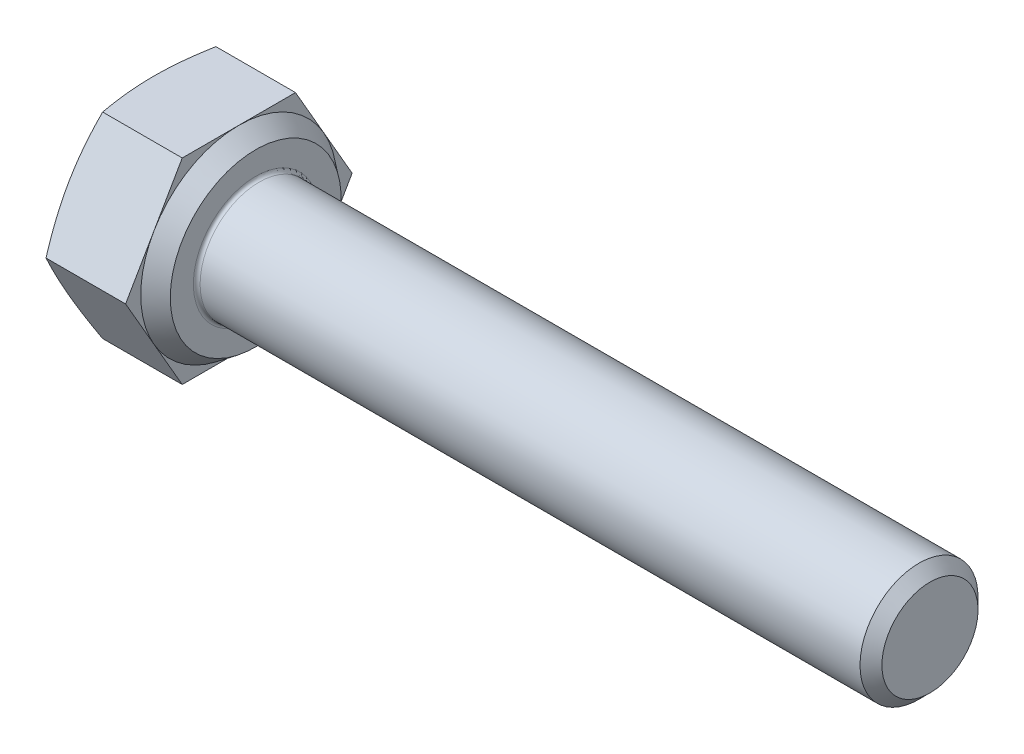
ISO-10303-21;
HEADER;
FILE_DESCRIPTION(('STEP AP214'),'2;1');
FILE_NAME('part.step','',(''),(''),'','','');
FILE_SCHEMA(('AUTOMOTIVE_DESIGN { 1 0 10303 214 1 1 1 1 }'));
ENDSEC;
DATA;
#1=APPLICATION_CONTEXT('core data for automotive mechanical design processes');
#2=APPLICATION_PROTOCOL_DEFINITION('international standard','automotive_design',2000,#1);
#3=PRODUCT_CONTEXT('',#1,'mechanical');
#4=PRODUCT('Part','Part','',(#3));
#5=PRODUCT_RELATED_PRODUCT_CATEGORY('part','',(#4));
#6=PRODUCT_DEFINITION_FORMATION('','',#4);
#7=PRODUCT_DEFINITION_CONTEXT('part definition',#1,'design');
#8=PRODUCT_DEFINITION('design','',#6,#7);
#9=PRODUCT_DEFINITION_SHAPE('','',#8);
#10=(LENGTH_UNIT() NAMED_UNIT(*) SI_UNIT(.MILLI.,.METRE.));
#11=(NAMED_UNIT(*) PLANE_ANGLE_UNIT() SI_UNIT($,.RADIAN.));
#12=(NAMED_UNIT(*) SI_UNIT($,.STERADIAN.) SOLID_ANGLE_UNIT());
#13=UNCERTAINTY_MEASURE_WITH_UNIT(LENGTH_MEASURE(1.E-05),#10,'distance_accuracy_value','');
#14=(GEOMETRIC_REPRESENTATION_CONTEXT(3) GLOBAL_UNCERTAINTY_ASSIGNED_CONTEXT((#13)) GLOBAL_UNIT_ASSIGNED_CONTEXT((#10,
#11,#12)) REPRESENTATION_CONTEXT('',''));
#15=CARTESIAN_POINT('',(0.,0.,0.));
#16=DIRECTION('',(0.,0.,1.));
#17=DIRECTION('',(1.,0.,0.));
#18=AXIS2_PLACEMENT_3D('',#15,#16,#17);
#19=CARTESIAN_POINT('',(3.025,0.,0.));
#20=DIRECTION('',(1.,0.,0.));
#21=DIRECTION('',(0.,0.,-1.));
#22=AXIS2_PLACEMENT_3D('',#19,#20,#21);
#23=PLANE('',#22);
#24=CARTESIAN_POINT('',(3.025,0.,0.));
#25=DIRECTION('',(1.,0.,0.));
#26=DIRECTION('',(0.,0.,-1.));
#27=AXIS2_PLACEMENT_3D('',#24,#25,#26);
#28=CIRCLE('',#27,1.85);
#29=CARTESIAN_POINT('',(3.025,0.,-1.85));
#30=VERTEX_POINT('',#29);
#31=EDGE_CURVE('E188',#30,#30,#28,.F.);
#32=ORIENTED_EDGE('',*,*,#31,.T.);
#33=EDGE_LOOP('',(#32));
#34=FACE_BOUND('',#33,.T.);
#35=CARTESIAN_POINT('',(3.025,0.,0.));
#36=DIRECTION('',(-1.,0.,0.));
#37=DIRECTION('',(0.,0.,1.));
#38=AXIS2_PLACEMENT_3D('',#35,#36,#37);
#39=CIRCLE('',#38,2.535);
#40=CARTESIAN_POINT('',(3.025,0.,2.535));
#41=VERTEX_POINT('',#40);
#42=EDGE_CURVE('E139',#41,#41,#39,.T.);
#43=ORIENTED_EDGE('',*,*,#42,.F.);
#44=EDGE_LOOP('',(#43));
#45=FACE_BOUND('',#44,.T.);
#46=ADVANCED_FACE('F33',(#34,#45),#23,.T.);
#47=CARTESIAN_POINT('',(2.525,0.,-3.36017856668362));
#48=DIRECTION('',(1.,0.,0.));
#49=DIRECTION('',(0.,0.,-1.));
#50=AXIS2_PLACEMENT_3D('',#47,#48,#49);
#51=PLANE('',#50);
#52=DIRECTION('',(0.,-0.866025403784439,0.5));
#53=VECTOR('',#52,1.);
#54=CARTESIAN_POINT('',(2.525,2.91,1.68008928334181));
#55=LINE('',#54,#53);
#56=CARTESIAN_POINT('',(2.525,2.91,1.68008928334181));
#57=VERTEX_POINT('',#56);
#58=CARTESIAN_POINT('',(2.525,1.455,2.52013392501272));
#59=VERTEX_POINT('',#58);
#60=EDGE_CURVE('E138',#57,#59,#55,.T.);
#61=ORIENTED_EDGE('',*,*,#60,.T.);
#62=CARTESIAN_POINT('',(2.525,0.,0.));
#63=DIRECTION('',(-1.,0.,0.));
#64=DIRECTION('',(0.,0.,1.));
#65=AXIS2_PLACEMENT_3D('',#62,#63,#64);
#66=CIRCLE('',#65,2.91);
#67=CARTESIAN_POINT('',(2.525,2.91,0.));
#68=VERTEX_POINT('',#67);
#69=EDGE_CURVE('E49',#59,#68,#66,.T.);
#70=ORIENTED_EDGE('',*,*,#69,.T.);
#71=DIRECTION('',(0.,0.,1.));
#72=VECTOR('',#71,1.);
#73=CARTESIAN_POINT('',(2.525,2.91,-1.68008928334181));
#74=LINE('',#73,#72);
#75=EDGE_CURVE('E135',#68,#57,#74,.T.);
#76=ORIENTED_EDGE('',*,*,#75,.T.);
#77=EDGE_LOOP('',(#61,#70,#76));
#78=FACE_BOUND('',#77,.T.);
#79=ADVANCED_FACE('F134',(#78),#51,.T.);
#80=CARTESIAN_POINT('',(2.525,2.91,-1.68008928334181));
#81=VERTEX_POINT('',#80);
#82=EDGE_CURVE('E145',#81,#68,#74,.T.);
#83=ORIENTED_EDGE('',*,*,#82,.T.);
#84=CARTESIAN_POINT('',(2.525,1.455,-2.52013392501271));
#85=VERTEX_POINT('',#84);
#86=EDGE_CURVE('E122',#68,#85,#66,.T.);
#87=ORIENTED_EDGE('',*,*,#86,.T.);
#88=DIRECTION('',(0.,0.866025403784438,0.5));
#89=VECTOR('',#88,1.);
#90=CARTESIAN_POINT('',(2.525,0.,-3.36017856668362));
#91=LINE('',#90,#89);
#92=EDGE_CURVE('E151',#85,#81,#91,.T.);
#93=ORIENTED_EDGE('',*,*,#92,.T.);
#94=EDGE_LOOP('',(#83,#87,#93));
#95=FACE_BOUND('',#94,.T.);
#96=ADVANCED_FACE('F150',(#95),#51,.T.);
#97=CARTESIAN_POINT('',(2.525,0.,-3.36017856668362));
#98=VERTEX_POINT('',#97);
#99=EDGE_CURVE('E148',#98,#85,#91,.T.);
#100=ORIENTED_EDGE('',*,*,#99,.T.);
#101=CARTESIAN_POINT('',(2.525,-1.455,-2.52013392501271));
#102=VERTEX_POINT('',#101);
#103=EDGE_CURVE('E125',#85,#102,#66,.T.);
#104=ORIENTED_EDGE('',*,*,#103,.T.);
#105=DIRECTION('',(0.,0.866025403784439,-0.5));
#106=VECTOR('',#105,1.);
#107=CARTESIAN_POINT('',(2.525,-2.91,-1.68008928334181));
#108=LINE('',#107,#106);
#109=EDGE_CURVE('E306',#102,#98,#108,.T.);
#110=ORIENTED_EDGE('',*,*,#109,.T.);
#111=EDGE_LOOP('',(#100,#104,#110));
#112=FACE_BOUND('',#111,.T.);
#113=ADVANCED_FACE('F337',(#112),#51,.T.);
#114=CARTESIAN_POINT('',(2.525,-2.91,-1.68008928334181));
#115=VERTEX_POINT('',#114);
#116=EDGE_CURVE('E304',#115,#102,#108,.T.);
#117=ORIENTED_EDGE('',*,*,#116,.T.);
#118=CARTESIAN_POINT('',(2.525,-2.91,0.));
#119=VERTEX_POINT('',#118);
#120=EDGE_CURVE('E338',#102,#119,#66,.T.);
#121=ORIENTED_EDGE('',*,*,#120,.T.);
#122=DIRECTION('',(0.,0.,-1.));
#123=VECTOR('',#122,1.);
#124=CARTESIAN_POINT('',(2.525,-2.91,1.68008928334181));
#125=LINE('',#124,#123);
#126=EDGE_CURVE('E162',#119,#115,#125,.T.);
#127=ORIENTED_EDGE('',*,*,#126,.T.);
#128=EDGE_LOOP('',(#117,#121,#127));
#129=FACE_BOUND('',#128,.T.);
#130=ADVANCED_FACE('F352',(#129),#51,.T.);
#131=CARTESIAN_POINT('',(2.525,-2.91,1.68008928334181));
#132=VERTEX_POINT('',#131);
#133=EDGE_CURVE('E163',#132,#119,#125,.T.);
#134=ORIENTED_EDGE('',*,*,#133,.T.);
#135=CARTESIAN_POINT('',(2.525,-1.455,2.52013392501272));
#136=VERTEX_POINT('',#135);
#137=EDGE_CURVE('E339',#119,#136,#66,.T.);
#138=ORIENTED_EDGE('',*,*,#137,.T.);
#139=DIRECTION('',(0.,-0.866025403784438,-0.5));
#140=VECTOR('',#139,1.);
#141=CARTESIAN_POINT('',(2.525,0.,3.36017856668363));
#142=LINE('',#141,#140);
#143=EDGE_CURVE('E158',#136,#132,#142,.T.);
#144=ORIENTED_EDGE('',*,*,#143,.T.);
#145=EDGE_LOOP('',(#134,#138,#144));
#146=FACE_BOUND('',#145,.T.);
#147=ADVANCED_FACE('F347',(#146),#51,.T.);
#148=CARTESIAN_POINT('',(2.525,0.,3.36017856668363));
#149=VERTEX_POINT('',#148);
#150=EDGE_CURVE('E159',#149,#136,#142,.T.);
#151=ORIENTED_EDGE('',*,*,#150,.T.);
#152=EDGE_CURVE('E140',#136,#59,#66,.T.);
#153=ORIENTED_EDGE('',*,*,#152,.T.);
#154=EDGE_CURVE('E153',#59,#149,#55,.T.);
#155=ORIENTED_EDGE('',*,*,#154,.T.);
#156=EDGE_LOOP('',(#151,#153,#155));
#157=FACE_BOUND('',#156,.T.);
#158=ADVANCED_FACE('F213',(#157),#51,.T.);
#159=CARTESIAN_POINT('',(2.525,-2.91,-1.68008928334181));
#160=DIRECTION('',(0.,0.5,0.866025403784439));
#161=DIRECTION('',(0.,-0.866025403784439,0.5));
#162=AXIS2_PLACEMENT_3D('',#159,#160,#161);
#163=PLANE('',#162);
#164=CARTESIAN_POINT('',(0.163893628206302,0.000199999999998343,-3.36029403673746));
#165=CARTESIAN_POINT('',(0.138555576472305,-0.120325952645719,-3.29070834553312));
#166=CARTESIAN_POINT('',(0.115506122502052,-0.241249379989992,-3.22089317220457));
#167=CARTESIAN_POINT('',(0.0749540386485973,-0.483882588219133,-3.08080882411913));
#168=CARTESIAN_POINT('',(0.0574557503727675,-0.605592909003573,-3.01053933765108));
#169=CARTESIAN_POINT('',(0.029152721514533,-0.848449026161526,-2.87032629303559));
#170=CARTESIAN_POINT('',(0.0182862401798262,-0.969589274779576,-2.80038593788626));
#171=CARTESIAN_POINT('',(0.00371122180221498,-1.2121530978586,-2.66034164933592));
#172=CARTESIAN_POINT('',(0.,-1.3335765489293,-2.59023778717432));
#173=CARTESIAN_POINT('',(0.,-1.5764234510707,-2.45003006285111));
#174=CARTESIAN_POINT('',(0.00371122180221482,-1.6978469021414,-2.37992620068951));
#175=CARTESIAN_POINT('',(0.0182862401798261,-1.94041072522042,-2.23988191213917));
#176=CARTESIAN_POINT('',(0.0291527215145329,-2.06155097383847,-2.16994155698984));
#177=CARTESIAN_POINT('',(0.0574557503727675,-2.30440709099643,-2.02972851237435));
#178=CARTESIAN_POINT('',(0.0749540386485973,-2.42611741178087,-1.9594590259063));
#179=CARTESIAN_POINT('',(0.115506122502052,-2.66875062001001,-1.81937467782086));
#180=CARTESIAN_POINT('',(0.138555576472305,-2.78967404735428,-1.74955950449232));
#181=CARTESIAN_POINT('',(0.163893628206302,-2.9102,-1.67997381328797));
#182=B_SPLINE_CURVE_WITH_KNOTS('',3,(#164,#165,#166,#167,#168,#169,#170,#171,#172,#173,#174,
#175,#176,#177,#178,#179,#180,#181),.UNSPECIFIED.,.F.,.F.,(4,2,2,2,2,2,2,2,4),(0.,
0.424421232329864,0.849173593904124,1.26990875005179,1.69048600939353,2.11106326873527,
2.53179842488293,2.95655078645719,3.38097201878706),.UNSPECIFIED.);
#183=CARTESIAN_POINT('',(0.163851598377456,0.,-3.36017856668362));
#184=VERTEX_POINT('',#183);
#185=CARTESIAN_POINT('',(0.,-1.455,-2.52013392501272));
#186=VERTEX_POINT('',#185);
#187=EDGE_CURVE('E321',#184,#186,#182,.T.);
#188=ORIENTED_EDGE('',*,*,#187,.F.);
#189=DIRECTION('',(-1.,0.,0.));
#190=VECTOR('',#189,1.);
#191=CARTESIAN_POINT('',(2.525,0.,-3.36017856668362));
#192=LINE('',#191,#190);
#193=EDGE_CURVE('E178',#98,#184,#192,.T.);
#194=ORIENTED_EDGE('',*,*,#193,.F.);
#195=ORIENTED_EDGE('',*,*,#109,.F.);
#196=ORIENTED_EDGE('',*,*,#116,.F.);
#197=DIRECTION('',(-1.,0.,0.));
#198=VECTOR('',#197,1.);
#199=CARTESIAN_POINT('',(2.525,-2.91,-1.68008928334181));
#200=LINE('',#199,#198);
#201=CARTESIAN_POINT('',(0.163851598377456,-2.91,-1.68008928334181));
#202=VERTEX_POINT('',#201);
#203=EDGE_CURVE('E166',#115,#202,#200,.T.);
#204=ORIENTED_EDGE('',*,*,#203,.T.);
#205=EDGE_CURVE('E246',#186,#202,#182,.T.);
#206=ORIENTED_EDGE('',*,*,#205,.F.);
#207=EDGE_LOOP('',(#188,#194,#195,#196,#204,#206));
#208=FACE_BOUND('',#207,.T.);
#209=ADVANCED_FACE('F35',(#208),#163,.F.);
#210=CARTESIAN_POINT('',(2.525,0.,-3.36017856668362));
#211=DIRECTION('',(0.,-0.5,0.866025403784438));
#212=DIRECTION('',(0.,-0.866025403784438,-0.5));
#213=AXIS2_PLACEMENT_3D('',#210,#211,#212);
#214=PLANE('',#213);
#215=CARTESIAN_POINT('',(0.163893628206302,2.9102,-1.67997381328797));
#216=CARTESIAN_POINT('',(0.138555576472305,2.78967404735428,-1.74955950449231));
#217=CARTESIAN_POINT('',(0.115506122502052,2.66875062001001,-1.81937467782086));
#218=CARTESIAN_POINT('',(0.0749540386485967,2.42611741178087,-1.9594590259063));
#219=CARTESIAN_POINT('',(0.057455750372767,2.30440709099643,-2.02972851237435));
#220=CARTESIAN_POINT('',(0.0291527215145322,2.06155097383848,-2.16994155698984));
#221=CARTESIAN_POINT('',(0.0182862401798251,1.94041072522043,-2.23988191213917));
#222=CARTESIAN_POINT('',(0.00371122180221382,1.6978469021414,-2.37992620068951));
#223=CARTESIAN_POINT('',(0.,1.5764234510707,-2.45003006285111));
#224=CARTESIAN_POINT('',(0.,1.3335765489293,-2.59023778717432));
#225=CARTESIAN_POINT('',(0.00371122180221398,1.2121530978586,-2.66034164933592));
#226=CARTESIAN_POINT('',(0.0182862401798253,0.969589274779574,-2.80038593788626));
#227=CARTESIAN_POINT('',(0.0291527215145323,0.848449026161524,-2.87032629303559));
#228=CARTESIAN_POINT('',(0.0574557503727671,0.605592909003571,-3.01053933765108));
#229=CARTESIAN_POINT('',(0.0749540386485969,0.483882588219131,-3.08080882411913));
#230=CARTESIAN_POINT('',(0.115506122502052,0.241249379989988,-3.22089317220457));
#231=CARTESIAN_POINT('',(0.138555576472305,0.120325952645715,-3.29070834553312));
#232=CARTESIAN_POINT('',(0.163893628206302,-0.000200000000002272,-3.36029403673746));
#233=B_SPLINE_CURVE_WITH_KNOTS('',3,(#215,#216,#217,#218,#219,#220,#221,#222,#223,#224,#225,
#226,#227,#228,#229,#230,#231,#232),.UNSPECIFIED.,.F.,.F.,(4,2,2,2,2,2,2,2,4),(0.,
0.424421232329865,0.849173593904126,1.26990875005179,1.69048600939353,2.11106326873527,
2.53179842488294,2.9565507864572,3.38097201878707),.UNSPECIFIED.);
#234=CARTESIAN_POINT('',(0.163851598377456,2.91,-1.68008928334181));
#235=VERTEX_POINT('',#234);
#236=CARTESIAN_POINT('',(0.,1.455,-2.52013392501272));
#237=VERTEX_POINT('',#236);
#238=EDGE_CURVE('E261',#235,#237,#233,.T.);
#239=ORIENTED_EDGE('',*,*,#238,.F.);
#240=DIRECTION('',(-1.,0.,0.));
#241=VECTOR('',#240,1.);
#242=CARTESIAN_POINT('',(2.525,2.91,-1.68008928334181));
#243=LINE('',#242,#241);
#244=EDGE_CURVE('E176',#81,#235,#243,.T.);
#245=ORIENTED_EDGE('',*,*,#244,.F.);
#246=ORIENTED_EDGE('',*,*,#92,.F.);
#247=ORIENTED_EDGE('',*,*,#99,.F.);
#248=ORIENTED_EDGE('',*,*,#193,.T.);
#249=EDGE_CURVE('E257',#237,#184,#233,.T.);
#250=ORIENTED_EDGE('',*,*,#249,.F.);
#251=EDGE_LOOP('',(#239,#245,#246,#247,#248,#250));
#252=FACE_BOUND('',#251,.T.);
#253=ADVANCED_FACE('F267',(#252),#214,.F.);
#254=CARTESIAN_POINT('',(2.525,2.91,-1.68008928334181));
#255=DIRECTION('',(0.,-1.,0.));
#256=DIRECTION('',(0.,0.,-1.));
#257=AXIS2_PLACEMENT_3D('',#254,#255,#256);
#258=PLANE('',#257);
#259=CARTESIAN_POINT('',(0.875557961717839,2.91,-4.44828566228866));
#260=CARTESIAN_POINT('',(0.835467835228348,2.91,-4.31662666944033));
#261=CARTESIAN_POINT('',(0.795845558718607,2.91,-4.18482268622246));
#262=CARTESIAN_POINT('',(0.717795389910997,2.91,-3.92085066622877));
#263=CARTESIAN_POINT('',(0.679367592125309,2.91,-3.78868260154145));
#264=CARTESIAN_POINT('',(0.60390114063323,2.91,-3.52368212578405));
#265=CARTESIAN_POINT('',(0.566865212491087,2.91,-3.39084893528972));
#266=CARTESIAN_POINT('',(0.494616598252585,2.91,-3.12468925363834));
#267=CARTESIAN_POINT('',(0.459403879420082,2.91,-2.99136277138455));
#268=CARTESIAN_POINT('',(0.391671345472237,2.91,-2.72577136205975));
#269=CARTESIAN_POINT('',(0.359123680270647,2.91,-2.59351361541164));
#270=CARTESIAN_POINT('',(0.29680485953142,2.91,-2.32835118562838));
#271=CARTESIAN_POINT('',(0.267033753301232,2.91,-2.1954464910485));
#272=CARTESIAN_POINT('',(0.182899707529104,2.91,-1.79569866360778));
#273=CARTESIAN_POINT('',(0.133682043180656,2.91,-1.52769353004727));
#274=CARTESIAN_POINT('',(0.0774837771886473,2.91,-1.13855650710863));
#275=CARTESIAN_POINT('',(0.0622341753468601,2.91,-1.01861137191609));
#276=CARTESIAN_POINT('',(0.0364236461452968,2.91,-0.778222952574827));
#277=CARTESIAN_POINT('',(0.0258621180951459,2.91,-0.657779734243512));
#278=CARTESIAN_POINT('',(0.00993064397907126,2.91,-0.416625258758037));
#279=CARTESIAN_POINT('',(0.00455728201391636,2.91,-0.295914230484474));
#280=CARTESIAN_POINT('',(-0.000724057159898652,2.91,-0.0543712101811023));
#281=CARTESIAN_POINT('',(-0.000632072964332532,2.91,0.0664607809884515));
#282=CARTESIAN_POINT('',(0.00502629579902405,2.91,0.308607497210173));
#283=CARTESIAN_POINT('',(0.0106204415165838,2.91,0.429921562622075));
#284=CARTESIAN_POINT('',(0.0270260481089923,2.91,0.672193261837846));
#285=CARTESIAN_POINT('',(0.0378376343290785,2.91,0.793150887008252));
#286=CARTESIAN_POINT('',(0.0641712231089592,2.91,1.03465051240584));
#287=CARTESIAN_POINT('',(0.0796972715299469,2.91,1.15519206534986));
#288=CARTESIAN_POINT('',(0.114834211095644,2.91,1.39567050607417));
#289=CARTESIAN_POINT('',(0.134445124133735,2.91,1.51560739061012));
#290=CARTESIAN_POINT('',(0.200678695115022,2.91,1.88714397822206));
#291=CARTESIAN_POINT('',(0.253192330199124,2.91,2.13769052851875));
#292=CARTESIAN_POINT('',(0.368326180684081,2.91,2.6364568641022));
#293=CARTESIAN_POINT('',(0.430950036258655,2.91,2.88467577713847));
#294=CARTESIAN_POINT('',(0.562935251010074,2.91,3.37964250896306));
#295=CARTESIAN_POINT('',(0.632305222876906,2.91,3.62638800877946));
#296=CARTESIAN_POINT('',(0.775507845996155,2.91,4.11852497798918));
#297=CARTESIAN_POINT('',(0.849339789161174,2.91,4.36391665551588));
#298=CARTESIAN_POINT('',(0.999259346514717,2.91,4.85104203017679));
#299=CARTESIAN_POINT('',(1.07531306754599,2.91,5.09278620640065));
#300=CARTESIAN_POINT('',(1.22958080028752,2.91,5.57559477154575));
#301=CARTESIAN_POINT('',(1.30779491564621,2.91,5.81665912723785));
#302=CARTESIAN_POINT('',(1.46549805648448,2.91,6.2973562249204));
#303=CARTESIAN_POINT('',(1.54498111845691,2.91,6.53699092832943));
#304=CARTESIAN_POINT('',(1.70513896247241,2.91,7.01584015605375));
#305=CARTESIAN_POINT('',(1.7858136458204,2.91,7.25505471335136));
#306=CARTESIAN_POINT('',(1.86690522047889,2.91,7.49412582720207));
#307=B_SPLINE_CURVE_WITH_KNOTS('',3,(#259,#260,#261,#262,#263,#264,#265,#266,#267,#268,#269,
#270,#271,#272,#273,#274,#275,#276,#277,#278,#279,#280,#281,#282,#283,#284,#285,#286,#287,#288,
#289,#290,#291,#292,#293,#294,#295,#296,#297,#298,#299,#300,#301,#302,#303,#304,#305,#306),
.UNSPECIFIED.,.F.,.F.,(4,2,2,2,2,2,2,2,2,2,2,2,2,2,2,2,2,2,2,2,2,2,2,4),(0.,0.412884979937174,
0.825802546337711,1.2394905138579,1.65317105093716,2.0617509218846,2.47033804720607,
3.28711451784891,3.64977276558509,4.01238453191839,4.37475739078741,4.73712769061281,
5.10133575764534,5.4655525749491,5.83008284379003,6.19461506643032,6.96221383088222,
7.73008958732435,8.49895888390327,9.26770648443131,10.027968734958,10.7882675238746,
11.5456814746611,12.3030330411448),.UNSPECIFIED.);
#308=CARTESIAN_POINT('',(0.163851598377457,2.91,1.68008928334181));
#309=VERTEX_POINT('',#308);
#310=CARTESIAN_POINT('',(0.,2.91,0.));
#311=VERTEX_POINT('',#310);
#312=EDGE_CURVE('E57',#309,#311,#307,.F.);
#313=ORIENTED_EDGE('',*,*,#312,.F.);
#314=DIRECTION('',(-1.,0.,0.));
#315=VECTOR('',#314,1.);
#316=CARTESIAN_POINT('',(2.525,2.91,1.68008928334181));
#317=LINE('',#316,#315);
#318=EDGE_CURVE('E147',#57,#309,#317,.T.);
#319=ORIENTED_EDGE('',*,*,#318,.F.);
#320=ORIENTED_EDGE('',*,*,#75,.F.);
#321=ORIENTED_EDGE('',*,*,#82,.F.);
#322=ORIENTED_EDGE('',*,*,#244,.T.);
#323=EDGE_CURVE('E262',#311,#235,#307,.F.);
#324=ORIENTED_EDGE('',*,*,#323,.F.);
#325=EDGE_LOOP('',(#313,#319,#320,#321,#322,#324));
#326=FACE_BOUND('',#325,.T.);
#327=ADVANCED_FACE('F143',(#326),#258,.F.);
#328=CARTESIAN_POINT('',(2.525,2.91,1.68008928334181));
#329=DIRECTION('',(0.,-0.5,-0.866025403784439));
#330=DIRECTION('',(0.,0.866025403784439,-0.5));
#331=AXIS2_PLACEMENT_3D('',#328,#329,#330);
#332=PLANE('',#331);
#333=CARTESIAN_POINT('',(0.163893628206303,-0.000199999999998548,3.36029403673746));
#334=CARTESIAN_POINT('',(0.138555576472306,0.120325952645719,3.29070834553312));
#335=CARTESIAN_POINT('',(0.115506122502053,0.241249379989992,3.22089317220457));
#336=CARTESIAN_POINT('',(0.0749540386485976,0.483882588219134,3.08080882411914));
#337=CARTESIAN_POINT('',(0.0574557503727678,0.605592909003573,3.01053933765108));
#338=CARTESIAN_POINT('',(0.0291527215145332,0.848449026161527,2.87032629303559));
#339=CARTESIAN_POINT('',(0.0182862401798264,0.969589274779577,2.80038593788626));
#340=CARTESIAN_POINT('',(0.00371122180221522,1.2121530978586,2.66034164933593));
#341=CARTESIAN_POINT('',(0.,1.3335765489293,2.59023778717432));
#342=CARTESIAN_POINT('',(0.,1.5764234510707,2.45003006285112));
#343=CARTESIAN_POINT('',(0.00371122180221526,1.69784690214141,2.37992620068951));
#344=CARTESIAN_POINT('',(0.0182862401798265,1.94041072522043,2.23988191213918));
#345=CARTESIAN_POINT('',(0.0291527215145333,2.06155097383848,2.16994155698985));
#346=CARTESIAN_POINT('',(0.0574557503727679,2.30440709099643,2.02972851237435));
#347=CARTESIAN_POINT('',(0.0749540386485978,2.42611741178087,1.9594590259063));
#348=CARTESIAN_POINT('',(0.115506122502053,2.66875062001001,1.81937467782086));
#349=CARTESIAN_POINT('',(0.138555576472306,2.78967404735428,1.74955950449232));
#350=CARTESIAN_POINT('',(0.163893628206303,2.9102,1.67997381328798));
#351=B_SPLINE_CURVE_WITH_KNOTS('',3,(#333,#334,#335,#336,#337,#338,#339,#340,#341,#342,#343,
#344,#345,#346,#347,#348,#349,#350),.UNSPECIFIED.,.F.,.F.,(4,2,2,2,2,2,2,2,4),(0.,
0.424421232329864,0.849173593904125,1.26990875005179,1.69048600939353,2.11106326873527,
2.53179842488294,2.9565507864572,3.38097201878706),.UNSPECIFIED.);
#352=CARTESIAN_POINT('',(0.163851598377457,0.,3.36017856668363));
#353=VERTEX_POINT('',#352);
#354=CARTESIAN_POINT('',(0.,1.455,2.52013392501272));
#355=VERTEX_POINT('',#354);
#356=EDGE_CURVE('E251',#353,#355,#351,.T.);
#357=ORIENTED_EDGE('',*,*,#356,.F.);
#358=DIRECTION('',(-1.,0.,0.));
#359=VECTOR('',#358,1.);
#360=CARTESIAN_POINT('',(2.525,0.,3.36017856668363));
#361=LINE('',#360,#359);
#362=EDGE_CURVE('E172',#149,#353,#361,.T.);
#363=ORIENTED_EDGE('',*,*,#362,.F.);
#364=ORIENTED_EDGE('',*,*,#154,.F.);
#365=ORIENTED_EDGE('',*,*,#60,.F.);
#366=ORIENTED_EDGE('',*,*,#318,.T.);
#367=EDGE_CURVE('E312',#355,#309,#351,.T.);
#368=ORIENTED_EDGE('',*,*,#367,.F.);
#369=EDGE_LOOP('',(#357,#363,#364,#365,#366,#368));
#370=FACE_BOUND('',#369,.T.);
#371=ADVANCED_FACE('F273',(#370),#332,.F.);
#372=CARTESIAN_POINT('',(2.525,0.,3.36017856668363));
#373=DIRECTION('',(0.,0.5,-0.866025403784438));
#374=DIRECTION('',(0.,0.866025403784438,0.5));
#375=AXIS2_PLACEMENT_3D('',#372,#373,#374);
#376=PLANE('',#375);
#377=CARTESIAN_POINT('',(0.163893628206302,-2.9102,1.67997381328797));
#378=CARTESIAN_POINT('',(0.138555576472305,-2.78967404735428,1.74955950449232));
#379=CARTESIAN_POINT('',(0.115506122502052,-2.66875062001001,1.81937467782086));
#380=CARTESIAN_POINT('',(0.0749540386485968,-2.42611741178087,1.9594590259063));
#381=CARTESIAN_POINT('',(0.057455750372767,-2.30440709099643,2.02972851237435));
#382=CARTESIAN_POINT('',(0.0291527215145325,-2.06155097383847,2.16994155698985));
#383=CARTESIAN_POINT('',(0.0182862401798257,-1.94041072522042,2.23988191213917));
#384=CARTESIAN_POINT('',(0.00371122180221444,-1.6978469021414,2.37992620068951));
#385=CARTESIAN_POINT('',(0.,-1.5764234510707,2.45003006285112));
#386=CARTESIAN_POINT('',(0.,-1.3335765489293,2.59023778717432));
#387=CARTESIAN_POINT('',(0.0037112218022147,-1.21215309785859,2.66034164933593));
#388=CARTESIAN_POINT('',(0.0182862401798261,-0.969589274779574,2.80038593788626));
#389=CARTESIAN_POINT('',(0.0291527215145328,-0.848449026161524,2.87032629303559));
#390=CARTESIAN_POINT('',(0.0574557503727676,-0.60559290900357,3.01053933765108));
#391=CARTESIAN_POINT('',(0.0749540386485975,-0.483882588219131,3.08080882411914));
#392=CARTESIAN_POINT('',(0.115506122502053,-0.241249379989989,3.22089317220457));
#393=CARTESIAN_POINT('',(0.138555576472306,-0.120325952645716,3.29070834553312));
#394=CARTESIAN_POINT('',(0.163893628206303,0.000200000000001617,3.36029403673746));
#395=B_SPLINE_CURVE_WITH_KNOTS('',3,(#377,#378,#379,#380,#381,#382,#383,#384,#385,#386,#387,
#388,#389,#390,#391,#392,#393,#394),.UNSPECIFIED.,.F.,.F.,(4,2,2,2,2,2,2,2,4),(0.,
0.424421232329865,0.849173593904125,1.26990875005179,1.69048600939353,2.11106326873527,
2.53179842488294,2.9565507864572,3.38097201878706),.UNSPECIFIED.);
#396=CARTESIAN_POINT('',(0.163851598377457,-2.91,1.68008928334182));
#397=VERTEX_POINT('',#396);
#398=CARTESIAN_POINT('',(0.,-1.455,2.52013392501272));
#399=VERTEX_POINT('',#398);
#400=EDGE_CURVE('E239',#397,#399,#395,.T.);
#401=ORIENTED_EDGE('',*,*,#400,.F.);
#402=DIRECTION('',(-1.,0.,0.));
#403=VECTOR('',#402,1.);
#404=CARTESIAN_POINT('',(2.525,-2.91,1.68008928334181));
#405=LINE('',#404,#403);
#406=EDGE_CURVE('E169',#132,#397,#405,.T.);
#407=ORIENTED_EDGE('',*,*,#406,.F.);
#408=ORIENTED_EDGE('',*,*,#143,.F.);
#409=ORIENTED_EDGE('',*,*,#150,.F.);
#410=ORIENTED_EDGE('',*,*,#362,.T.);
#411=EDGE_CURVE('E317',#399,#353,#395,.T.);
#412=ORIENTED_EDGE('',*,*,#411,.F.);
#413=EDGE_LOOP('',(#401,#407,#408,#409,#410,#412));
#414=FACE_BOUND('',#413,.T.);
#415=ADVANCED_FACE('F276',(#414),#376,.F.);
#416=CARTESIAN_POINT('',(2.525,-2.91,1.68008928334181));
#417=DIRECTION('',(0.,1.,0.));
#418=DIRECTION('',(0.,0.,1.));
#419=AXIS2_PLACEMENT_3D('',#416,#417,#418);
#420=PLANE('',#419);
#421=CARTESIAN_POINT('',(0.87555811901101,-2.91,-4.44828617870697));
#422=CARTESIAN_POINT('',(0.835467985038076,-2.91,-4.31662716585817));
#423=CARTESIAN_POINT('',(0.795845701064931,-2.91,-4.18482316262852));
#424=CARTESIAN_POINT('',(0.71779551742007,-2.91,-3.92085110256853));
#425=CARTESIAN_POINT('',(0.67936771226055,-2.91,-3.78868301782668));
#426=CARTESIAN_POINT('',(0.603901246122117,-2.91,-3.52368250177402));
#427=CARTESIAN_POINT('',(0.566865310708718,-2.91,-3.39084929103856));
#428=CARTESIAN_POINT('',(0.494616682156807,-2.91,-3.12468956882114));
#429=CARTESIAN_POINT('',(0.459403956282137,-2.91,-2.99136306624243));
#430=CARTESIAN_POINT('',(0.391671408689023,-2.91,-2.7257716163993));
#431=CARTESIAN_POINT('',(0.359123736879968,-2.91,-2.59351384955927));
#432=CARTESIAN_POINT('',(0.296804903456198,-2.91,-2.32835137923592));
#433=CARTESIAN_POINT('',(0.267033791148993,-2.91,-2.19544666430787));
#434=CARTESIAN_POINT('',(0.182899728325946,-2.91,-1.79569877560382));
#435=CARTESIAN_POINT('',(0.133682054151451,-2.91,-1.52769360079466));
#436=CARTESIAN_POINT('',(0.0774837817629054,-2.91,-1.13855654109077));
#437=CARTESIAN_POINT('',(0.0622341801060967,-2.91,-1.01861141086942));
#438=CARTESIAN_POINT('',(0.0364236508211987,-2.91,-0.778223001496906));
#439=CARTESIAN_POINT('',(0.0258621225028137,-2.91,-0.657779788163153));
#440=CARTESIAN_POINT('',(0.00993064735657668,-2.91,-0.41662532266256));
#441=CARTESIAN_POINT('',(0.00455728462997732,-2.91,-0.295914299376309));
#442=CARTESIAN_POINT('',(-0.000724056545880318,-2.91,-0.0543712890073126));
#443=CARTESIAN_POINT('',(-0.000632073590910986,-2.91,0.0664606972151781));
#444=CARTESIAN_POINT('',(0.00502629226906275,-2.91,0.308607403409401));
#445=CARTESIAN_POINT('',(0.0106204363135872,-2.91,0.429921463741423));
#446=CARTESIAN_POINT('',(0.027026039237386,-2.91,0.672193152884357));
#447=CARTESIAN_POINT('',(0.0378376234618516,-2.91,0.793150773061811));
#448=CARTESIAN_POINT('',(0.0641712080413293,-2.91,1.03465038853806));
#449=CARTESIAN_POINT('',(0.0796972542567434,-2.91,1.15519193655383));
#450=CARTESIAN_POINT('',(0.114834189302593,-2.91,1.39567036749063));
#451=CARTESIAN_POINT('',(0.134445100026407,-2.91,1.51560724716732));
#452=CARTESIAN_POINT('',(0.200678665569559,-2.91,1.88714382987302));
#453=CARTESIAN_POINT('',(0.253192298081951,-2.91,2.13769038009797));
#454=CARTESIAN_POINT('',(0.368326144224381,-2.91,2.63645671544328));
#455=CARTESIAN_POINT('',(0.430949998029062,-2.91,2.88467562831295));
#456=CARTESIAN_POINT('',(0.562935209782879,-2.91,3.37964235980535));
#457=CARTESIAN_POINT('',(0.632305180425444,-2.91,3.62638785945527));
#458=CARTESIAN_POINT('',(0.775507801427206,-2.91,4.1185248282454));
#459=CARTESIAN_POINT('',(0.849339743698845,-2.91,4.363916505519));
#460=CARTESIAN_POINT('',(0.999259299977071,-2.91,4.85104188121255));
#461=CARTESIAN_POINT('',(1.07531302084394,-2.91,5.09278605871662));
#462=CARTESIAN_POINT('',(1.22958075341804,-2.91,5.57559462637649));
#463=CARTESIAN_POINT('',(1.30779486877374,-2.91,5.81665898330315));
#464=CARTESIAN_POINT('',(1.46549800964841,-2.91,6.29735608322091));
#465=CARTESIAN_POINT('',(1.54498107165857,-2.91,6.53699078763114));
#466=CARTESIAN_POINT('',(1.70513891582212,-2.91,7.01584001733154));
#467=CARTESIAN_POINT('',(1.78581359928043,-2.91,7.25505457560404));
#468=CARTESIAN_POINT('',(1.86690517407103,-2.91,7.49412569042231));
#469=B_SPLINE_CURVE_WITH_KNOTS('',3,(#421,#422,#423,#424,#425,#426,#427,#428,#429,#430,#431,
#432,#433,#434,#435,#436,#437,#438,#439,#440,#441,#442,#443,#444,#445,#446,#447,#448,#449,#450,
#451,#452,#453,#454,#455,#456,#457,#458,#459,#460,#461,#462,#463,#464,#465,#466,#467,#468),
.UNSPECIFIED.,.F.,.F.,(4,2,2,2,2,2,2,2,2,2,2,2,2,2,2,2,2,2,2,2,2,2,2,4),(0.,0.41288504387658,
0.825802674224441,1.23949070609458,1.65317130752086,2.0617512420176,2.47033843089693,
3.28711502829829,3.64977326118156,4.01238501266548,4.37475785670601,4.73712814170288,
5.10133619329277,5.46555299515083,5.83008324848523,6.19461545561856,6.96221421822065,
7.73008997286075,8.49895926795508,9.26770686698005,10.0279691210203,10.788267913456,
11.5456818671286,12.3030334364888),.UNSPECIFIED.);
#470=CARTESIAN_POINT('',(0.,-2.91,0.));
#471=VERTEX_POINT('',#470);
#472=EDGE_CURVE('E295',#202,#471,#469,.T.);
#473=ORIENTED_EDGE('',*,*,#472,.F.);
#474=ORIENTED_EDGE('',*,*,#203,.F.);
#475=ORIENTED_EDGE('',*,*,#126,.F.);
#476=ORIENTED_EDGE('',*,*,#133,.F.);
#477=ORIENTED_EDGE('',*,*,#406,.T.);
#478=EDGE_CURVE('E229',#471,#397,#469,.T.);
#479=ORIENTED_EDGE('',*,*,#478,.F.);
#480=EDGE_LOOP('',(#473,#474,#475,#476,#477,#479));
#481=FACE_BOUND('',#480,.T.);
#482=ADVANCED_FACE('F280',(#481),#420,.F.);
#483=CARTESIAN_POINT('',(0.,0.,0.));
#484=DIRECTION('',(1.,0.,0.));
#485=DIRECTION('',(0.,0.,-1.));
#486=AXIS2_PLACEMENT_3D('',#483,#484,#485);
#487=CONICAL_SURFACE('',#486,2.91,1.22173047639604);
#488=ORIENTED_EDGE('',*,*,#249,.T.);
#489=ORIENTED_EDGE('',*,*,#187,.T.);
#490=CARTESIAN_POINT('',(0.,0.,0.));
#491=DIRECTION('',(1.,0.,0.));
#492=DIRECTION('',(0.,0.,-1.));
#493=AXIS2_PLACEMENT_3D('',#490,#491,#492);
#494=CIRCLE('',#493,2.91000000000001);
#495=EDGE_CURVE('E181',#186,#237,#494,.T.);
#496=ORIENTED_EDGE('',*,*,#495,.T.);
#497=EDGE_LOOP('',(#488,#489,#496));
#498=FACE_BOUND('',#497,.T.);
#499=ADVANCED_FACE('F284',(#498),#487,.T.);
#500=ORIENTED_EDGE('',*,*,#205,.T.);
#501=ORIENTED_EDGE('',*,*,#472,.T.);
#502=EDGE_CURVE('E184',#471,#186,#494,.T.);
#503=ORIENTED_EDGE('',*,*,#502,.T.);
#504=EDGE_LOOP('',(#500,#501,#503));
#505=FACE_BOUND('',#504,.T.);
#506=ADVANCED_FACE('F289',(#505),#487,.T.);
#507=ORIENTED_EDGE('',*,*,#400,.T.);
#508=EDGE_CURVE('E330',#399,#471,#494,.T.);
#509=ORIENTED_EDGE('',*,*,#508,.T.);
#510=ORIENTED_EDGE('',*,*,#478,.T.);
#511=EDGE_LOOP('',(#507,#509,#510));
#512=FACE_BOUND('',#511,.T.);
#513=ADVANCED_FACE('F224',(#512),#487,.T.);
#514=ORIENTED_EDGE('',*,*,#356,.T.);
#515=EDGE_CURVE('E336',#355,#399,#494,.T.);
#516=ORIENTED_EDGE('',*,*,#515,.T.);
#517=ORIENTED_EDGE('',*,*,#411,.T.);
#518=EDGE_LOOP('',(#514,#516,#517));
#519=FACE_BOUND('',#518,.T.);
#520=ADVANCED_FACE('F223',(#519),#487,.T.);
#521=ORIENTED_EDGE('',*,*,#312,.T.);
#522=CARTESIAN_POINT('',(0.,0.,0.));
#523=DIRECTION('',(-1.,0.,0.));
#524=DIRECTION('',(0.,0.,1.));
#525=AXIS2_PLACEMENT_3D('',#522,#523,#524);
#526=CIRCLE('',#525,2.91);
#527=EDGE_CURVE('E335',#355,#311,#526,.T.);
#528=ORIENTED_EDGE('',*,*,#527,.F.);
#529=ORIENTED_EDGE('',*,*,#367,.T.);
#530=EDGE_LOOP('',(#521,#528,#529));
#531=FACE_BOUND('',#530,.T.);
#532=ADVANCED_FACE('F218',(#531),#487,.T.);
#533=ORIENTED_EDGE('',*,*,#323,.T.);
#534=ORIENTED_EDGE('',*,*,#238,.T.);
#535=EDGE_CURVE('E185',#237,#311,#494,.T.);
#536=ORIENTED_EDGE('',*,*,#535,.T.);
#537=EDGE_LOOP('',(#533,#534,#536));
#538=FACE_BOUND('',#537,.T.);
#539=ADVANCED_FACE('F222',(#538),#487,.T.);
#540=CARTESIAN_POINT('',(0.,0.,-3.36017856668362));
#541=DIRECTION('',(1.,0.,0.));
#542=DIRECTION('',(0.,0.,-1.));
#543=AXIS2_PLACEMENT_3D('',#540,#541,#542);
#544=PLANE('',#543);
#545=ORIENTED_EDGE('',*,*,#535,.F.);
#546=ORIENTED_EDGE('',*,*,#495,.F.);
#547=ORIENTED_EDGE('',*,*,#502,.F.);
#548=ORIENTED_EDGE('',*,*,#508,.F.);
#549=ORIENTED_EDGE('',*,*,#515,.F.);
#550=ORIENTED_EDGE('',*,*,#527,.T.);
#551=EDGE_LOOP('',(#545,#546,#547,#548,#549,#550));
#552=FACE_BOUND('',#551,.T.);
#553=ADVANCED_FACE('F225',(#552),#544,.F.);
#554=CARTESIAN_POINT('',(2.525,0.,0.));
#555=DIRECTION('',(-1.,0.,0.));
#556=DIRECTION('',(0.,0.,1.));
#557=AXIS2_PLACEMENT_3D('',#554,#555,#556);
#558=CONICAL_SURFACE('',#557,2.91,0.643501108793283);
#559=ORIENTED_EDGE('',*,*,#42,.T.);
#560=EDGE_LOOP('',(#559));
#561=FACE_BOUND('',#560,.T.);
#562=ORIENTED_EDGE('',*,*,#69,.F.);
#563=ORIENTED_EDGE('',*,*,#152,.F.);
#564=ORIENTED_EDGE('',*,*,#137,.F.);
#565=ORIENTED_EDGE('',*,*,#120,.F.);
#566=ORIENTED_EDGE('',*,*,#103,.F.);
#567=ORIENTED_EDGE('',*,*,#86,.F.);
#568=EDGE_LOOP('',(#562,#563,#564,#565,#566,#567));
#569=FACE_BOUND('',#568,.T.);
#570=ADVANCED_FACE('F123',(#561,#569),#558,.T.);
#571=CARTESIAN_POINT('',(23.025,0.,0.));
#572=DIRECTION('',(-1.,0.,0.));
#573=DIRECTION('',(0.,0.,1.));
#574=AXIS2_PLACEMENT_3D('',#571,#572,#573);
#575=CYLINDRICAL_SURFACE('',#574,1.75);
#576=CARTESIAN_POINT('',(22.7,0.,0.));
#577=DIRECTION('',(1.,0.,0.));
#578=DIRECTION('',(0.,0.,-1.));
#579=AXIS2_PLACEMENT_3D('',#576,#577,#578);
#580=CIRCLE('',#579,1.75);
#581=CARTESIAN_POINT('',(22.7,0.,1.75));
#582=VERTEX_POINT('',#581);
#583=EDGE_CURVE('E12',#582,#582,#580,.F.);
#584=ORIENTED_EDGE('',*,*,#583,.T.);
#585=EDGE_LOOP('',(#584));
#586=FACE_BOUND('',#585,.T.);
#587=CARTESIAN_POINT('',(3.125,0.,0.));
#588=DIRECTION('',(1.,0.,0.));
#589=DIRECTION('',(0.,0.,-1.));
#590=AXIS2_PLACEMENT_3D('',#587,#588,#589);
#591=CIRCLE('',#590,1.75);
#592=CARTESIAN_POINT('',(3.125,0.,-1.75));
#593=VERTEX_POINT('',#592);
#594=EDGE_CURVE('E129',#593,#593,#591,.T.);
#595=ORIENTED_EDGE('',*,*,#594,.T.);
#596=EDGE_LOOP('',(#595));
#597=FACE_BOUND('',#596,.T.);
#598=ADVANCED_FACE('F454',(#586,#597),#575,.T.);
#599=CARTESIAN_POINT('',(23.025,0.,0.));
#600=DIRECTION('',(1.,0.,0.));
#601=DIRECTION('',(0.,0.,-1.));
#602=AXIS2_PLACEMENT_3D('',#599,#600,#601);
#603=PLANE('',#602);
#604=CARTESIAN_POINT('',(23.025,0.,0.));
#605=DIRECTION('',(1.,0.,0.));
#606=DIRECTION('',(0.,0.,-1.));
#607=AXIS2_PLACEMENT_3D('',#604,#605,#606);
#608=CIRCLE('',#607,1.425);
#609=CARTESIAN_POINT('',(23.025,0.,1.425));
#610=VERTEX_POINT('',#609);
#611=EDGE_CURVE('E42',#610,#610,#608,.T.);
#612=ORIENTED_EDGE('',*,*,#611,.T.);
#613=EDGE_LOOP('',(#612));
#614=FACE_BOUND('',#613,.T.);
#615=ADVANCED_FACE('F193',(#614),#603,.T.);
#616=CARTESIAN_POINT('',(3.125,0.,0.));
#617=DIRECTION('',(1.,0.,0.));
#618=DIRECTION('',(0.,0.,-1.));
#619=AXIS2_PLACEMENT_3D('',#616,#617,#618);
#620=TOROIDAL_SURFACE('',#619,1.85,0.1);
#621=ORIENTED_EDGE('',*,*,#31,.F.);
#622=EDGE_LOOP('',(#621));
#623=FACE_BOUND('',#622,.T.);
#624=ORIENTED_EDGE('',*,*,#594,.F.);
#625=EDGE_LOOP('',(#624));
#626=FACE_BOUND('',#625,.T.);
#627=ADVANCED_FACE('F197',(#623,#626),#620,.F.);
#628=CARTESIAN_POINT('',(23.025,0.,0.));
#629=DIRECTION('',(-1.,0.,0.));
#630=DIRECTION('',(0.,0.,1.));
#631=AXIS2_PLACEMENT_3D('',#628,#629,#630);
#632=CONICAL_SURFACE('',#631,1.425,0.785398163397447);
#633=CARTESIAN_POINT('',(22.7,0.,1.75));
#634=CARTESIAN_POINT('',(22.7033854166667,0.,1.74661458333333));
#635=CARTESIAN_POINT('',(22.7067708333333,0.,1.74322916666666));
#636=CARTESIAN_POINT('',(22.7135416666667,0.,1.73645833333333));
#637=CARTESIAN_POINT('',(22.7169270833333,0.,1.73307291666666));
#638=CARTESIAN_POINT('',(22.7236979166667,0.,1.72630208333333));
#639=CARTESIAN_POINT('',(22.7270833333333,0.,1.72291666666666));
#640=CARTESIAN_POINT('',(22.7338541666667,0.,1.71614583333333));
#641=CARTESIAN_POINT('',(22.7372395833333,0.,1.71276041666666));
#642=CARTESIAN_POINT('',(22.7440104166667,0.,1.70598958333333));
#643=CARTESIAN_POINT('',(22.7473958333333,0.,1.70260416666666));
#644=CARTESIAN_POINT('',(22.7541666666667,0.,1.69583333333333));
#645=CARTESIAN_POINT('',(22.7575520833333,0.,1.69244791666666));
#646=CARTESIAN_POINT('',(22.7643229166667,0.,1.68567708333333));
#647=CARTESIAN_POINT('',(22.7677083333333,0.,1.68229166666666));
#648=CARTESIAN_POINT('',(22.7744791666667,0.,1.67552083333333));
#649=CARTESIAN_POINT('',(22.7778645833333,0.,1.67213541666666));
#650=CARTESIAN_POINT('',(22.7846354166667,0.,1.66536458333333));
#651=CARTESIAN_POINT('',(22.7880208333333,0.,1.66197916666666));
#652=CARTESIAN_POINT('',(22.7947916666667,0.,1.65520833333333));
#653=CARTESIAN_POINT('',(22.7981770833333,0.,1.65182291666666));
#654=CARTESIAN_POINT('',(22.8049479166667,0.,1.64505208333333));
#655=CARTESIAN_POINT('',(22.8083333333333,0.,1.64166666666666));
#656=CARTESIAN_POINT('',(22.8151041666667,0.,1.63489583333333));
#657=CARTESIAN_POINT('',(22.8184895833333,0.,1.63151041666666));
#658=CARTESIAN_POINT('',(22.8252604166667,0.,1.62473958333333));
#659=CARTESIAN_POINT('',(22.8286458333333,0.,1.62135416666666));
#660=CARTESIAN_POINT('',(22.8354166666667,0.,1.61458333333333));
#661=CARTESIAN_POINT('',(22.8388020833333,0.,1.61119791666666));
#662=CARTESIAN_POINT('',(22.8455729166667,0.,1.60442708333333));
#663=CARTESIAN_POINT('',(22.8489583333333,0.,1.60104166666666));
#664=CARTESIAN_POINT('',(22.8557291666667,0.,1.59427083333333));
#665=CARTESIAN_POINT('',(22.8591145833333,0.,1.59088541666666));
#666=CARTESIAN_POINT('',(22.8658854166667,0.,1.58411458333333));
#667=CARTESIAN_POINT('',(22.8692708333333,0.,1.58072916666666));
#668=CARTESIAN_POINT('',(22.8760416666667,0.,1.57395833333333));
#669=CARTESIAN_POINT('',(22.8794270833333,0.,1.57057291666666));
#670=CARTESIAN_POINT('',(22.8861979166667,0.,1.56380208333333));
#671=CARTESIAN_POINT('',(22.8895833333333,0.,1.56041666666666));
#672=CARTESIAN_POINT('',(22.8963541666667,0.,1.55364583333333));
#673=CARTESIAN_POINT('',(22.8997395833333,0.,1.55026041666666));
#674=CARTESIAN_POINT('',(22.9065104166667,0.,1.54348958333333));
#675=CARTESIAN_POINT('',(22.9098958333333,0.,1.54010416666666));
#676=CARTESIAN_POINT('',(22.9166666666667,0.,1.53333333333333));
#677=CARTESIAN_POINT('',(22.9200520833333,0.,1.52994791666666));
#678=CARTESIAN_POINT('',(22.9268229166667,0.,1.52317708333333));
#679=CARTESIAN_POINT('',(22.9302083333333,0.,1.51979166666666));
#680=CARTESIAN_POINT('',(22.9369791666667,0.,1.51302083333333));
#681=CARTESIAN_POINT('',(22.9403645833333,0.,1.50963541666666));
#682=CARTESIAN_POINT('',(22.9471354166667,0.,1.50286458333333));
#683=CARTESIAN_POINT('',(22.9505208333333,0.,1.49947916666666));
#684=CARTESIAN_POINT('',(22.9572916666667,0.,1.49270833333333));
#685=CARTESIAN_POINT('',(22.9606770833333,0.,1.48932291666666));
#686=CARTESIAN_POINT('',(22.9674479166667,0.,1.48255208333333));
#687=CARTESIAN_POINT('',(22.9708333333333,0.,1.47916666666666));
#688=CARTESIAN_POINT('',(22.9776041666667,0.,1.47239583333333));
#689=CARTESIAN_POINT('',(22.9809895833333,0.,1.46901041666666));
#690=CARTESIAN_POINT('',(22.9877604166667,0.,1.46223958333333));
#691=CARTESIAN_POINT('',(22.9911458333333,0.,1.45885416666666));
#692=CARTESIAN_POINT('',(22.9979166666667,0.,1.45208333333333));
#693=CARTESIAN_POINT('',(23.0013020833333,0.,1.44869791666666));
#694=CARTESIAN_POINT('',(23.0080729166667,0.,1.44192708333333));
#695=CARTESIAN_POINT('',(23.0114583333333,0.,1.43854166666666));
#696=CARTESIAN_POINT('',(23.0182291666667,0.,1.43177083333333));
#697=CARTESIAN_POINT('',(23.0216145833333,0.,1.42838541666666));
#698=CARTESIAN_POINT('',(23.025,0.,1.425));
#699=B_SPLINE_CURVE_WITH_KNOTS('',3,(#633,#634,#635,#636,#637,#638,#639,#640,#641,#642,#643,
#644,#645,#646,#647,#648,#649,#650,#651,#652,#653,#654,#655,#656,#657,#658,#659,#660,#661,#662,
#663,#664,#665,#666,#667,#668,#669,#670,#671,#672,#673,#674,#675,#676,#677,#678,#679,#680,#681,
#682,#683,#684,#685,#686,#687,#688,#689,#690,#691,#692,#693,#694,#695,#696,#697,#698),
.UNSPECIFIED.,.F.,.F.,(4,2,2,2,2,2,2,2,2,2,2,2,2,2,2,2,2,2,2,2,2,2,2,2,2,2,2,2,2,2,2,2,4),(0.,
0.0143631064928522,0.0287262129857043,0.0430893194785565,0.0574524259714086,0.0718155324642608,
0.0861786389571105,0.100541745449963,0.114904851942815,0.129267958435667,0.143631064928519,
0.157994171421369,0.172357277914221,0.186720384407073,0.201083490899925,0.215446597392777,
0.229809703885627,0.244172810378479,0.258535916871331,0.272899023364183,0.287262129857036,
0.301625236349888,0.315988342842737,0.33035144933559,0.344714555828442,0.359077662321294,
0.373440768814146,0.387803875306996,0.402166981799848,0.4165300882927,0.430893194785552,
0.445256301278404,0.459619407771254),.UNSPECIFIED.);
#700=EDGE_CURVE('BSEAM195',#582,#610,#699,.T.);
#701=ORIENTED_EDGE('',*,*,#583,.F.);
#702=ORIENTED_EDGE('',*,*,#611,.F.);
#703=ORIENTED_EDGE('',*,*,#700,.T.);
#704=ORIENTED_EDGE('',*,*,#700,.F.);
#705=EDGE_LOOP('',(#701,#703,#702,#704));
#706=FACE_BOUND('',#705,.T.);
#707=ADVANCED_FACE('F195',(#706),#632,.T.);
#708=CLOSED_SHELL('',(#46,#79,#96,#113,#130,#147,#158,#209,#253,#327,#371,#415,#482,#499,#506,
#513,#520,#532,#539,#553,#570,#598,#615,#627,#707));
#709=MANIFOLD_SOLID_BREP('B2',#708);
#710=ADVANCED_BREP_SHAPE_REPRESENTATION('',(#18,#709),#14);
#711=SHAPE_DEFINITION_REPRESENTATION(#9,#710);
ENDSEC;
END-ISO-10303-21;
